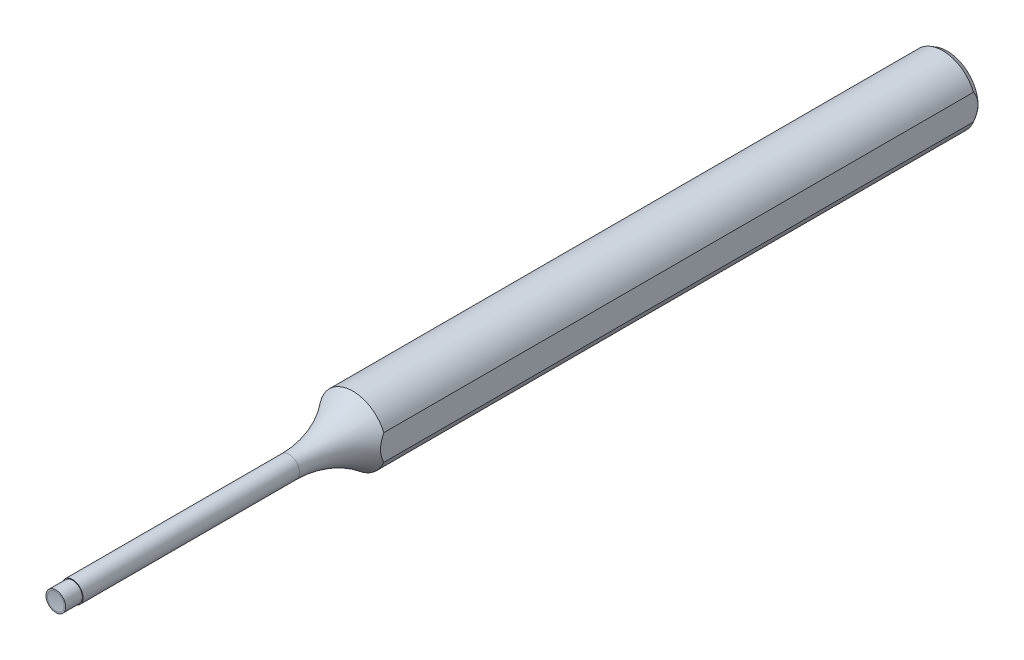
ISO-10303-21;
HEADER;
FILE_DESCRIPTION(('STEP AP214'),'2;1');
FILE_NAME('part.step','',(''),(''),'','','');
FILE_SCHEMA(('AUTOMOTIVE_DESIGN { 1 0 10303 214 1 1 1 1 }'));
ENDSEC;
DATA;
#1=APPLICATION_CONTEXT('core data for automotive mechanical design processes');
#2=APPLICATION_PROTOCOL_DEFINITION('international standard','automotive_design',2000,#1);
#3=PRODUCT_CONTEXT('',#1,'mechanical');
#4=PRODUCT('Part','Part','',(#3));
#5=PRODUCT_RELATED_PRODUCT_CATEGORY('part','',(#4));
#6=PRODUCT_DEFINITION_FORMATION('','',#4);
#7=PRODUCT_DEFINITION_CONTEXT('part definition',#1,'design');
#8=PRODUCT_DEFINITION('design','',#6,#7);
#9=PRODUCT_DEFINITION_SHAPE('','',#8);
#10=(LENGTH_UNIT() NAMED_UNIT(*) SI_UNIT(.MILLI.,.METRE.));
#11=(NAMED_UNIT(*) PLANE_ANGLE_UNIT() SI_UNIT($,.RADIAN.));
#12=(NAMED_UNIT(*) SI_UNIT($,.STERADIAN.) SOLID_ANGLE_UNIT());
#13=UNCERTAINTY_MEASURE_WITH_UNIT(LENGTH_MEASURE(1.E-05),#10,'distance_accuracy_value','');
#14=(GEOMETRIC_REPRESENTATION_CONTEXT(3) GLOBAL_UNCERTAINTY_ASSIGNED_CONTEXT((#13)) GLOBAL_UNIT_ASSIGNED_CONTEXT((#10,
#11,#12)) REPRESENTATION_CONTEXT('',''));
#15=CARTESIAN_POINT('',(0.,0.,0.));
#16=DIRECTION('',(0.,0.,1.));
#17=DIRECTION('',(1.,0.,0.));
#18=AXIS2_PLACEMENT_3D('',#15,#16,#17);
#19=CARTESIAN_POINT('',(0.,0.,-42.3333333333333));
#20=DIRECTION('',(0.,0.,1.));
#21=DIRECTION('',(1.,0.,0.));
#22=AXIS2_PLACEMENT_3D('',#19,#20,#21);
#23=CYLINDRICAL_SURFACE('',#22,1.5);
#24=CARTESIAN_POINT('',(0.,0.,-33.2401421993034));
#25=DIRECTION('',(0.,0.,1.));
#26=DIRECTION('',(0.,-1.,0.));
#27=AXIS2_PLACEMENT_3D('',#24,#25,#26);
#28=CIRCLE('',#27,1.5);
#29=CARTESIAN_POINT('',(0.,-1.5,-33.2401421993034));
#30=VERTEX_POINT('',#29);
#31=EDGE_CURVE('E79',#30,#30,#28,.F.);
#32=ORIENTED_EDGE('',*,*,#31,.F.);
#33=EDGE_LOOP('',(#32));
#34=FACE_BOUND('',#33,.T.);
#35=CARTESIAN_POINT('',(0.,0.,-2.3825));
#36=DIRECTION('',(0.,0.,1.));
#37=DIRECTION('',(1.,0.,0.));
#38=AXIS2_PLACEMENT_3D('',#35,#36,#37);
#39=CIRCLE('',#38,1.5);
#40=CARTESIAN_POINT('',(1.5,0.,-2.3825));
#41=VERTEX_POINT('',#40);
#42=EDGE_CURVE('E90',#41,#41,#39,.F.);
#43=ORIENTED_EDGE('',*,*,#42,.T.);
#44=EDGE_LOOP('',(#43));
#45=FACE_BOUND('',#44,.T.);
#46=ADVANCED_FACE('F42',(#34,#45),#23,.T.);
#47=CARTESIAN_POINT('',(0.,0.,-2.3825));
#48=DIRECTION('',(0.,0.,1.));
#49=DIRECTION('',(1.,0.,0.));
#50=AXIS2_PLACEMENT_3D('',#47,#48,#49);
#51=PLANE('',#50);
#52=ORIENTED_EDGE('',*,*,#42,.F.);
#53=EDGE_LOOP('',(#52));
#54=FACE_BOUND('',#53,.T.);
#55=CARTESIAN_POINT('',(0.,0.,-2.3825));
#56=DIRECTION('',(0.,0.,1.));
#57=DIRECTION('',(1.,0.,0.));
#58=AXIS2_PLACEMENT_3D('',#55,#56,#57);
#59=CIRCLE('',#58,1.4);
#60=CARTESIAN_POINT('',(1.4,0.,-2.3825));
#61=VERTEX_POINT('',#60);
#62=EDGE_CURVE('E98',#61,#61,#59,.T.);
#63=ORIENTED_EDGE('',*,*,#62,.F.);
#64=EDGE_LOOP('',(#63));
#65=FACE_BOUND('',#64,.T.);
#66=ADVANCED_FACE('F109',(#54,#65),#51,.T.);
#67=CARTESIAN_POINT('',(0.,0.,-2.3825));
#68=DIRECTION('',(0.,0.,1.));
#69=DIRECTION('',(1.,0.,0.));
#70=AXIS2_PLACEMENT_3D('',#67,#68,#69);
#71=CYLINDRICAL_SURFACE('',#70,1.4);
#72=ORIENTED_EDGE('',*,*,#62,.T.);
#73=EDGE_LOOP('',(#72));
#74=FACE_BOUND('',#73,.T.);
#75=CARTESIAN_POINT('',(0.,0.,0.));
#76=DIRECTION('',(0.,0.,1.));
#77=DIRECTION('',(1.,0.,0.));
#78=AXIS2_PLACEMENT_3D('',#75,#76,#77);
#79=CIRCLE('',#78,1.4);
#80=CARTESIAN_POINT('',(1.4,0.,0.));
#81=VERTEX_POINT('',#80);
#82=EDGE_CURVE('E121',#81,#81,#79,.T.);
#83=ORIENTED_EDGE('',*,*,#82,.F.);
#84=EDGE_LOOP('',(#83));
#85=FACE_BOUND('',#84,.T.);
#86=ADVANCED_FACE('F115',(#74,#85),#71,.T.);
#87=CARTESIAN_POINT('',(0.,0.,0.));
#88=DIRECTION('',(0.,0.,1.));
#89=DIRECTION('',(1.,0.,0.));
#90=AXIS2_PLACEMENT_3D('',#87,#88,#89);
#91=PLANE('',#90);
#92=CARTESIAN_POINT('',(0.,0.,0.));
#93=DIRECTION('',(0.,0.,1.));
#94=DIRECTION('',(0.,-1.,0.));
#95=AXIS2_PLACEMENT_3D('',#92,#93,#94);
#96=CIRCLE('',#95,1.2);
#97=CARTESIAN_POINT('',(0.,-1.2,0.));
#98=VERTEX_POINT('',#97);
#99=EDGE_CURVE('E126',#98,#98,#96,.T.);
#100=ORIENTED_EDGE('',*,*,#99,.F.);
#101=EDGE_LOOP('',(#100));
#102=FACE_BOUND('',#101,.T.);
#103=ORIENTED_EDGE('',*,*,#82,.T.);
#104=EDGE_LOOP('',(#103));
#105=FACE_BOUND('',#104,.T.);
#106=ADVANCED_FACE('F156',(#102,#105),#91,.T.);
#107=CARTESIAN_POINT('',(0.,0.,9.45414723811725));
#108=DIRECTION('',(0.,0.,1.));
#109=DIRECTION('',(0.,-1.,0.));
#110=AXIS2_PLACEMENT_3D('',#107,#108,#109);
#111=SPHERICAL_SURFACE('',#110,9.53);
#112=ORIENTED_EDGE('',*,*,#99,.T.);
#113=EDGE_LOOP('',(#112));
#114=FACE_BOUND('',#113,.T.);
#115=ADVANCED_FACE('F159',(#114),#111,.F.);
#116=CARTESIAN_POINT('',(0.,0.,-33.2401421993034));
#117=DIRECTION('',(0.,0.,-1.));
#118=DIRECTION('',(0.,1.,0.));
#119=AXIS2_PLACEMENT_3D('',#116,#117,#118);
#120=TOROIDAL_SURFACE('',#119,15.795,14.295);
#121=CARTESIAN_POINT('',(4.39819012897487,11.6381710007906,-47.1362247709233));
#122=CARTESIAN_POINT('',(4.39819012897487,11.3889502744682,-47.0799782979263));
#123=CARTESIAN_POINT('',(4.39819012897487,11.1410367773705,-47.0180183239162));
#124=CARTESIAN_POINT('',(4.39819012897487,10.6482517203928,-46.8831588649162));
#125=CARTESIAN_POINT('',(4.39819012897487,10.40337958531,-46.810261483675));
#126=CARTESIAN_POINT('',(4.39819012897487,9.91749162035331,-46.6541478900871));
#127=CARTESIAN_POINT('',(4.39819012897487,9.67646909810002,-46.5709524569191));
#128=CARTESIAN_POINT('',(4.39819012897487,9.19805999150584,-46.3946803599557));
#129=CARTESIAN_POINT('',(4.39819012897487,8.96067355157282,-46.3016033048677));
#130=CARTESIAN_POINT('',(4.39819012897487,8.4962421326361,-46.1088922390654));
#131=CARTESIAN_POINT('',(4.39819012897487,8.26909249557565,-46.0095098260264));
#132=CARTESIAN_POINT('',(4.39819012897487,7.81850771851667,-45.8026495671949));
#133=CARTESIAN_POINT('',(4.39819012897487,7.59507271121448,-45.6951714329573));
#134=CARTESIAN_POINT('',(4.39819012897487,7.1518795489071,-45.4728689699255));
#135=CARTESIAN_POINT('',(4.39819012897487,6.93212163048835,-45.3580441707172));
#136=CARTESIAN_POINT('',(4.39819012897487,6.49611845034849,-45.121928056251));
#137=CARTESIAN_POINT('',(4.39819012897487,6.27987317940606,-45.0006367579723));
#138=CARTESIAN_POINT('',(4.39819012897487,5.89219956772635,-44.7767036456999));
#139=CARTESIAN_POINT('',(4.39819012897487,5.72021975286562,-44.6750119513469));
#140=CARTESIAN_POINT('',(4.39819012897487,5.37798939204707,-44.4687585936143));
#141=CARTESIAN_POINT('',(4.39819012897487,5.20773887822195,-44.364196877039));
#142=CARTESIAN_POINT('',(4.39819012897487,4.86840590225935,-44.1529078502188));
#143=CARTESIAN_POINT('',(4.39819012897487,4.69932446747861,-44.0461788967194));
#144=CARTESIAN_POINT('',(4.39819012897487,4.36187536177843,-43.8316187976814));
#145=CARTESIAN_POINT('',(4.39819012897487,4.19350766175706,-43.7237876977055));
#146=CARTESIAN_POINT('',(4.39819012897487,3.85626340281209,-43.5080163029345));
#147=CARTESIAN_POINT('',(4.39819012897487,3.68738660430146,-43.4000763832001));
#148=CARTESIAN_POINT('',(4.39819012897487,3.34841343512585,-43.1860229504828));
#149=CARTESIAN_POINT('',(4.39819012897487,3.1783167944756,-43.0799098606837));
#150=CARTESIAN_POINT('',(4.39819012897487,2.83582634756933,-42.8720890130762));
#151=CARTESIAN_POINT('',(4.39819012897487,2.66343693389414,-42.7703740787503));
#152=CARTESIAN_POINT('',(4.39819012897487,2.31438532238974,-42.5745969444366));
#153=CARTESIAN_POINT('',(4.39819012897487,2.13772547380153,-42.4805306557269));
#154=CARTESIAN_POINT('',(4.39819012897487,1.84069669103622,-42.3356229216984));
#155=CARTESIAN_POINT('',(4.39819012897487,1.72212658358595,-42.2811289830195));
#156=CARTESIAN_POINT('',(4.39819012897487,1.48181047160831,-42.1794500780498));
#157=CARTESIAN_POINT('',(4.39819012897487,1.3600636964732,-42.132266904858));
#158=CARTESIAN_POINT('',(4.39819012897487,1.11408105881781,-42.0478101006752));
#159=CARTESIAN_POINT('',(4.39819012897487,0.989868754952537,-42.0104690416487));
#160=CARTESIAN_POINT('',(4.39819012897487,0.738477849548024,-41.9477427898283));
#161=CARTESIAN_POINT('',(4.39819012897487,0.611301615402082,-41.9223483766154));
#162=CARTESIAN_POINT('',(4.39819012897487,0.382624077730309,-41.8895750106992));
#163=CARTESIAN_POINT('',(4.39819012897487,0.281510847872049,-41.8794894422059));
#164=CARTESIAN_POINT('',(4.39819012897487,0.0787881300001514,-41.8685448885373));
#165=CARTESIAN_POINT('',(4.39819012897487,-0.0228212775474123,-41.8676844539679));
#166=CARTESIAN_POINT('',(4.39819012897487,-0.225757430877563,-41.8752495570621));
#167=CARTESIAN_POINT('',(4.39819012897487,-0.327083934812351,-41.8836814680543));
#168=CARTESIAN_POINT('',(4.39819012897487,-0.528617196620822,-41.909320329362));
#169=CARTESIAN_POINT('',(4.39819012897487,-0.628823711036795,-41.9265291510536));
#170=CARTESIAN_POINT('',(4.39819012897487,-0.870500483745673,-41.9779297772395));
#171=CARTESIAN_POINT('',(4.39819012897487,-1.01109182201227,-42.0162468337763));
#172=CARTESIAN_POINT('',(4.39819012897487,-1.28815455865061,-42.1055816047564));
#173=CARTESIAN_POINT('',(4.39819012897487,-1.42462293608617,-42.1566083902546));
#174=CARTESIAN_POINT('',(4.39819012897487,-1.69469086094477,-42.2685279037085));
#175=CARTESIAN_POINT('',(4.39819012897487,-1.82825809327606,-42.3294974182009));
#176=CARTESIAN_POINT('',(4.39819012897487,-2.0260369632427,-42.4260719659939));
#177=CARTESIAN_POINT('',(4.39819012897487,-2.09152803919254,-42.459113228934));
#178=CARTESIAN_POINT('',(4.39819012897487,-2.22175843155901,-42.5266357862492));
#179=CARTESIAN_POINT('',(4.39819012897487,-2.28649780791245,-42.5611169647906));
#180=CARTESIAN_POINT('',(4.39819012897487,-2.49804609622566,-42.6763097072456));
#181=CARTESIAN_POINT('',(4.39819012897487,-2.64348743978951,-42.7595275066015));
#182=CARTESIAN_POINT('',(4.39819012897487,-2.93208318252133,-42.9298514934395));
#183=CARTESIAN_POINT('',(4.39819012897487,-3.07523708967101,-43.0169585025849));
#184=CARTESIAN_POINT('',(4.39819012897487,-3.36026429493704,-43.1934500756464));
#185=CARTESIAN_POINT('',(4.39819012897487,-3.50213663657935,-43.2828361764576));
#186=CARTESIAN_POINT('',(4.39819012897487,-3.78524512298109,-43.462577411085));
#187=CARTESIAN_POINT('',(4.39819012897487,-3.92648132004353,-43.5529324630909));
#188=CARTESIAN_POINT('',(4.39819012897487,-4.20915503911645,-43.7338126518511));
#189=CARTESIAN_POINT('',(4.39819012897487,-4.35059253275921,-43.8243378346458));
#190=CARTESIAN_POINT('',(4.39819012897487,-4.63392320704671,-44.0046767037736));
#191=CARTESIAN_POINT('',(4.39819012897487,-4.77581639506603,-44.0944903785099));
#192=CARTESIAN_POINT('',(4.39819012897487,-5.20264641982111,-44.3618624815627));
#193=CARTESIAN_POINT('',(4.39819012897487,-5.48884745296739,-44.5374262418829));
#194=CARTESIAN_POINT('',(4.39819012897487,-6.06374748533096,-44.8778319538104));
#195=CARTESIAN_POINT('',(4.39819012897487,-6.35239311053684,-45.0427633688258));
#196=CARTESIAN_POINT('',(4.39819012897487,-6.93601295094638,-45.3611974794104));
#197=CARTESIAN_POINT('',(4.39819012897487,-7.2309881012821,-45.514698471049));
#198=CARTESIAN_POINT('',(4.39819012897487,-7.827388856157,-45.8080350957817));
#199=CARTESIAN_POINT('',(4.39819012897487,-8.12880912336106,-45.9478815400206));
#200=CARTESIAN_POINT('',(4.39819012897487,-8.73822796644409,-46.2123125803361));
#201=CARTESIAN_POINT('',(4.39819012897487,-9.04622497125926,-46.3369007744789));
#202=CARTESIAN_POINT('',(4.39819012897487,-9.54210522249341,-46.5222029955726));
#203=CARTESIAN_POINT('',(4.39819012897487,-9.72798606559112,-46.5883134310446));
#204=CARTESIAN_POINT('',(4.39819012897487,-10.1017900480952,-46.7143886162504));
#205=CARTESIAN_POINT('',(4.39819012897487,-10.2897128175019,-46.7743544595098));
#206=CARTESIAN_POINT('',(4.39819012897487,-10.6699881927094,-46.8886664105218));
#207=CARTESIAN_POINT('',(4.39819012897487,-10.8623664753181,-46.9429271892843));
#208=CARTESIAN_POINT('',(4.39819012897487,-11.2489548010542,-47.0446990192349));
#209=CARTESIAN_POINT('',(4.39819012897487,-11.4431653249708,-47.0922082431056));
#210=CARTESIAN_POINT('',(4.39819012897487,-11.6381710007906,-47.1362247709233));
#211=B_SPLINE_CURVE_WITH_KNOTS('',3,(#121,#122,#123,#124,#125,#126,#127,#128,#129,#130,#131,
#132,#133,#134,#135,#136,#137,#138,#139,#140,#141,#142,#143,#144,#145,#146,#147,#148,#149,#150,
#151,#152,#153,#154,#155,#156,#157,#158,#159,#160,#161,#162,#163,#164,#165,#166,#167,#168,#169,
#170,#171,#172,#173,#174,#175,#176,#177,#178,#179,#180,#181,#182,#183,#184,#185,#186,#187,#188,
#189,#190,#191,#192,#193,#194,#195,#196,#197,#198,#199,#200,#201,#202,#203,#204,#205,#206,#207,
#208,#209,#210),.UNSPECIFIED.,.F.,.F.,(4,2,2,2,2,2,2,2,2,2,2,2,2,2,2,2,2,2,2,2,2,2,2,2,2,2,2,2,
2,2,2,2,2,2,2,2,2,2,2,2,2,2,2,2,4),(0.,0.766374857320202,1.5326024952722,2.2973085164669,
3.06204482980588,3.80569251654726,4.54936671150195,5.29308857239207,6.03680848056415,
6.63616299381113,7.23552862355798,7.83536706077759,8.43518080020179,9.03645738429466,
9.63787142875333,10.2382639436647,10.8383333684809,11.2296339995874,11.6210304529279,
12.0096713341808,12.3980117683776,12.7024663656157,13.0068731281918,13.3114888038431,
13.616169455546,14.0524984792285,14.4891398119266,14.9293285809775,15.1493780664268,
15.3694098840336,15.8719936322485,16.3746840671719,16.8777229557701,17.3807197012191,
17.8844984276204,18.3882853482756,19.3954517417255,20.3925741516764,21.3898449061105,
22.3863195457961,23.3825587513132,23.9743279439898,24.5659916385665,25.1655227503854,
25.7652158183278),.UNSPECIFIED.);
#212=CARTESIAN_POINT('',(4.39819012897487,1.83334355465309,-42.3333333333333));
#213=VERTEX_POINT('',#212);
#214=CARTESIAN_POINT('',(4.39819012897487,-1.83334355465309,-42.3333333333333));
#215=VERTEX_POINT('',#214);
#216=EDGE_CURVE('E58',#213,#215,#211,.T.);
#217=ORIENTED_EDGE('',*,*,#216,.F.);
#218=CARTESIAN_POINT('',(0.,0.,-42.3333333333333));
#219=DIRECTION('',(0.,0.,-1.));
#220=DIRECTION('',(0.,1.,0.));
#221=AXIS2_PLACEMENT_3D('',#218,#219,#220);
#222=CIRCLE('',#221,4.765);
#223=EDGE_CURVE('E130',#215,#213,#222,.T.);
#224=ORIENTED_EDGE('',*,*,#223,.F.);
#225=EDGE_LOOP('',(#217,#224));
#226=FACE_BOUND('',#225,.T.);
#227=ORIENTED_EDGE('',*,*,#31,.T.);
#228=EDGE_LOOP('',(#227));
#229=FACE_BOUND('',#228,.T.);
#230=ADVANCED_FACE('F105',(#226,#229),#120,.F.);
#231=CARTESIAN_POINT('',(0.,0.,-127.));
#232=DIRECTION('',(0.,0.,1.));
#233=DIRECTION('',(1.,0.,0.));
#234=AXIS2_PLACEMENT_3D('',#231,#232,#233);
#235=PLANE('',#234);
#236=CARTESIAN_POINT('',(0.,0.,-127.));
#237=DIRECTION('',(0.,0.,1.));
#238=DIRECTION('',(1.,0.,0.));
#239=AXIS2_PLACEMENT_3D('',#236,#237,#238);
#240=CIRCLE('',#239,4.39819012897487);
#241=CARTESIAN_POINT('',(4.39819012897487,0.,-127.));
#242=VERTEX_POINT('',#241);
#243=EDGE_CURVE('E85',#242,#242,#240,.F.);
#244=ORIENTED_EDGE('',*,*,#243,.T.);
#245=EDGE_LOOP('',(#244));
#246=FACE_BOUND('',#245,.T.);
#247=ADVANCED_FACE('F154',(#246),#235,.F.);
#248=CARTESIAN_POINT('',(0.,0.,-126.364666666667));
#249=DIRECTION('',(0.,0.,1.));
#250=DIRECTION('',(1.,0.,0.));
#251=AXIS2_PLACEMENT_3D('',#248,#249,#250);
#252=CONICAL_SURFACE('',#251,4.765,0.523598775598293);
#253=CARTESIAN_POINT('',(4.39819012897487,-5.33423797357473,-122.64314394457));
#254=CARTESIAN_POINT('',(4.39819012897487,-5.23964449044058,-122.769540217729));
#255=CARTESIAN_POINT('',(4.39819012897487,-5.14441079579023,-122.895461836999));
#256=CARTESIAN_POINT('',(4.39819012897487,-4.95244135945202,-123.14617446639));
#257=CARTESIAN_POINT('',(4.39819012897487,-4.85570546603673,-123.270965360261));
#258=CARTESIAN_POINT('',(4.39819012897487,-4.66025992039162,-123.519551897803));
#259=CARTESIAN_POINT('',(4.39819012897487,-4.56154555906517,-123.643343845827));
#260=CARTESIAN_POINT('',(4.39819012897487,-4.36213663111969,-123.889318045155));
#261=CARTESIAN_POINT('',(4.39819012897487,-4.26144213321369,-124.01150035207));
#262=CARTESIAN_POINT('',(4.39819012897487,-4.05667136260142,-124.255205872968));
#263=CARTESIAN_POINT('',(4.39819012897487,-3.95257064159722,-124.376708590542));
#264=CARTESIAN_POINT('',(4.39819012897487,-3.74160194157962,-124.617285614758));
#265=CARTESIAN_POINT('',(4.39819012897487,-3.63473408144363,-124.73636002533));
#266=CARTESIAN_POINT('',(4.39819012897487,-3.41782749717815,-124.971366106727));
#267=CARTESIAN_POINT('',(4.39819012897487,-3.30779217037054,-125.087300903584));
#268=CARTESIAN_POINT('',(4.39819012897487,-3.08382779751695,-125.315332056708));
#269=CARTESIAN_POINT('',(4.39819012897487,-2.96989944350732,-125.427429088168));
#270=CARTESIAN_POINT('',(4.39819012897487,-2.77186488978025,-125.614120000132));
#271=CARTESIAN_POINT('',(4.39819012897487,-2.68894403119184,-125.68996971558));
#272=CARTESIAN_POINT('',(4.39819012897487,-2.52044667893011,-125.838685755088));
#273=CARTESIAN_POINT('',(4.39819012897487,-2.43486999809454,-125.911551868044));
#274=CARTESIAN_POINT('',(4.39819012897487,-2.26054924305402,-126.053736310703));
#275=CARTESIAN_POINT('',(4.39819012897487,-2.17179979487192,-126.123048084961));
#276=CARTESIAN_POINT('',(4.39819012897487,-1.99088174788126,-126.257087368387));
#277=CARTESIAN_POINT('',(4.39819012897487,-1.89871312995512,-126.321814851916));
#278=CARTESIAN_POINT('',(4.39819012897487,-1.7090542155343,-126.446513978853));
#279=CARTESIAN_POINT('',(4.39819012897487,-1.61150226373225,-126.506392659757));
#280=CARTESIAN_POINT('',(4.39819012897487,-1.41210644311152,-126.618657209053));
#281=CARTESIAN_POINT('',(4.39819012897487,-1.31026180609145,-126.671041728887));
#282=CARTESIAN_POINT('',(4.39819012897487,-1.10269294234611,-126.766129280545));
#283=CARTESIAN_POINT('',(4.39819012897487,-0.996989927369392,-126.808878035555));
#284=CARTESIAN_POINT('',(4.39819012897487,-0.781614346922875,-126.882793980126));
#285=CARTESIAN_POINT('',(4.39819012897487,-0.67194529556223,-126.913971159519));
#286=CARTESIAN_POINT('',(4.39819012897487,-0.488020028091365,-126.954270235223));
#287=CARTESIAN_POINT('',(4.39819012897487,-0.414608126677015,-126.967290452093));
#288=CARTESIAN_POINT('',(4.39819012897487,-0.266950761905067,-126.987044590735));
#289=CARTESIAN_POINT('',(4.39819012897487,-0.192705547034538,-126.993780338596));
#290=CARTESIAN_POINT('',(4.39819012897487,-0.0439156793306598,-127.000708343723));
#291=CARTESIAN_POINT('',(4.39819012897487,0.0306289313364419,-127.000901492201));
#292=CARTESIAN_POINT('',(4.39819012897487,0.179435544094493,-126.994754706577));
#293=CARTESIAN_POINT('',(4.39819012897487,0.253697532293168,-126.988414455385));
#294=CARTESIAN_POINT('',(4.39819012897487,0.474629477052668,-126.959962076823));
#295=CARTESIAN_POINT('',(4.39819012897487,0.620159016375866,-126.928448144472));
#296=CARTESIAN_POINT('',(4.39819012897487,0.904823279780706,-126.844288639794));
#297=CARTESIAN_POINT('',(4.39819012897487,1.04395187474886,-126.791623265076));
#298=CARTESIAN_POINT('',(4.39819012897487,1.30222792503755,-126.675763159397));
#299=CARTESIAN_POINT('',(4.39819012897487,1.42203206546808,-126.61399704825));
#300=CARTESIAN_POINT('',(4.39819012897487,1.65585339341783,-126.480248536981));
#301=CARTESIAN_POINT('',(4.39819012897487,1.76986529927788,-126.40825703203));
#302=CARTESIAN_POINT('',(4.39819012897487,1.99362460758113,-126.255843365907));
#303=CARTESIAN_POINT('',(4.39819012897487,2.10332163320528,-126.175348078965));
#304=CARTESIAN_POINT('',(4.39819012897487,2.31795882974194,-126.008389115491));
#305=CARTESIAN_POINT('',(4.39819012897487,2.42290098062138,-125.921927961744));
#306=CARTESIAN_POINT('',(4.39819012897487,2.66383353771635,-125.714113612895));
#307=CARTESIAN_POINT('',(4.39819012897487,2.79822037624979,-125.590909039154));
#308=CARTESIAN_POINT('',(4.39819012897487,3.0611757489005,-125.338408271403));
#309=CARTESIAN_POINT('',(4.39819012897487,3.18974214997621,-125.209109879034));
#310=CARTESIAN_POINT('',(4.39819012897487,3.44236417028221,-124.945697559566));
#311=CARTESIAN_POINT('',(4.39819012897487,3.56641012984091,-124.811574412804));
#312=CARTESIAN_POINT('',(4.39819012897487,3.81058734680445,-124.539807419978));
#313=CARTESIAN_POINT('',(4.39819012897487,3.93071829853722,-124.402163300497));
#314=CARTESIAN_POINT('',(4.39819012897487,4.16130930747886,-124.131643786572));
#315=CARTESIAN_POINT('',(4.39819012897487,4.27194072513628,-123.998913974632));
#316=CARTESIAN_POINT('',(4.39819012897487,4.49075134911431,-123.731440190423));
#317=CARTESIAN_POINT('',(4.39819012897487,4.59893042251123,-123.59669610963));
#318=CARTESIAN_POINT('',(4.39819012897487,4.81265144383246,-123.326247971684));
#319=CARTESIAN_POINT('',(4.39819012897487,4.91820400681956,-123.190552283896));
#320=CARTESIAN_POINT('',(4.39819012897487,5.12750213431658,-122.917805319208));
#321=CARTESIAN_POINT('',(4.39819012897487,5.23124796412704,-122.780754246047));
#322=CARTESIAN_POINT('',(4.39819012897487,5.33423797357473,-122.64314394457));
#323=B_SPLINE_CURVE_WITH_KNOTS('',3,(#253,#254,#255,#256,#257,#258,#259,#260,#261,#262,#263,
#264,#265,#266,#267,#268,#269,#270,#271,#272,#273,#274,#275,#276,#277,#278,#279,#280,#281,#282,
#283,#284,#285,#286,#287,#288,#289,#290,#291,#292,#293,#294,#295,#296,#297,#298,#299,#300,#301,
#302,#303,#304,#305,#306,#307,#308,#309,#310,#311,#312,#313,#314,#315,#316,#317,#318,#319,#320,
#321,#322),.UNSPECIFIED.,.F.,.F.,(4,2,2,2,2,2,2,2,2,2,2,2,2,2,2,2,2,2,2,2,2,2,2,2,2,2,2,2,2,2,2,
2,2,2,4),(0.,0.473622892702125,0.947293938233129,1.42227179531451,1.89723319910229,
2.37719719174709,2.85714059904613,3.33658712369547,3.81594885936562,4.15302867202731,
4.49013229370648,4.82783680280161,5.16554320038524,5.50866767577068,5.85185381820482,
6.19337550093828,6.53460165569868,6.75803376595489,6.98140093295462,7.20473767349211,
7.42808525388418,7.87266697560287,8.31766589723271,8.72141386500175,9.12552361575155,
9.53344563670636,9.94119620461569,10.4878713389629,11.0347452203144,11.5827263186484,
12.1307500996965,12.6490872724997,13.1674524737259,13.6831809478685,14.1988330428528),.UNSPECIFIED.);
#324=CARTESIAN_POINT('',(4.39819012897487,-1.83334355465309,-126.364666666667));
#325=VERTEX_POINT('',#324);
#326=EDGE_CURVE('E73',#325,#242,#323,.T.);
#327=ORIENTED_EDGE('',*,*,#326,.F.);
#328=CARTESIAN_POINT('',(0.,0.,-126.364666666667));
#329=DIRECTION('',(0.,0.,1.));
#330=DIRECTION('',(1.,0.,0.));
#331=AXIS2_PLACEMENT_3D('',#328,#329,#330);
#332=CIRCLE('',#331,4.765);
#333=CARTESIAN_POINT('',(4.39819012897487,1.83334355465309,-126.364666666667));
#334=VERTEX_POINT('',#333);
#335=EDGE_CURVE('E83',#334,#325,#332,.T.);
#336=ORIENTED_EDGE('',*,*,#335,.F.);
#337=EDGE_CURVE('E64',#242,#334,#323,.T.);
#338=ORIENTED_EDGE('',*,*,#337,.F.);
#339=ORIENTED_EDGE('',*,*,#243,.F.);
#340=EDGE_LOOP('',(#327,#336,#338,#339));
#341=FACE_BOUND('',#340,.T.);
#342=ADVANCED_FACE('F44',(#341),#252,.T.);
#343=CARTESIAN_POINT('',(0.,0.,-127.));
#344=DIRECTION('',(0.,0.,1.));
#345=DIRECTION('',(1.,0.,0.));
#346=AXIS2_PLACEMENT_3D('',#343,#344,#345);
#347=CYLINDRICAL_SURFACE('',#346,4.765);
#348=DIRECTION('',(0.,0.,1.));
#349=VECTOR('',#348,1.);
#350=CARTESIAN_POINT('',(4.39819012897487,1.83334355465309,-127.));
#351=LINE('',#350,#349);
#352=EDGE_CURVE('E13',#334,#213,#351,.T.);
#353=ORIENTED_EDGE('',*,*,#352,.F.);
#354=ORIENTED_EDGE('',*,*,#335,.T.);
#355=DIRECTION('',(0.,0.,1.));
#356=VECTOR('',#355,1.);
#357=CARTESIAN_POINT('',(4.39819012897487,-1.83334355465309,-127.));
#358=LINE('',#357,#356);
#359=EDGE_CURVE('E52',#215,#325,#358,.F.);
#360=ORIENTED_EDGE('',*,*,#359,.F.);
#361=ORIENTED_EDGE('',*,*,#223,.T.);
#362=EDGE_LOOP('',(#353,#354,#360,#361));
#363=FACE_BOUND('',#362,.T.);
#364=ADVANCED_FACE('F88',(#363),#347,.T.);
#365=CARTESIAN_POINT('',(4.39819012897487,1.83334355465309,0.));
#366=DIRECTION('',(-1.,0.,0.));
#367=DIRECTION('',(0.,0.,1.));
#368=AXIS2_PLACEMENT_3D('',#365,#366,#367);
#369=PLANE('',#368);
#370=ORIENTED_EDGE('',*,*,#216,.T.);
#371=ORIENTED_EDGE('',*,*,#359,.T.);
#372=ORIENTED_EDGE('',*,*,#326,.T.);
#373=ORIENTED_EDGE('',*,*,#337,.T.);
#374=ORIENTED_EDGE('',*,*,#352,.T.);
#375=EDGE_LOOP('',(#370,#371,#372,#373,#374));
#376=FACE_BOUND('',#375,.T.);
#377=ADVANCED_FACE('F72',(#376),#369,.F.);
#378=CLOSED_SHELL('',(#46,#66,#86,#106,#115,#230,#247,#342,#364,#377));
#379=MANIFOLD_SOLID_BREP('B2',#378);
#380=ADVANCED_BREP_SHAPE_REPRESENTATION('',(#18,#379),#14);
#381=SHAPE_DEFINITION_REPRESENTATION(#9,#380);
ENDSEC;
END-ISO-10303-21;
